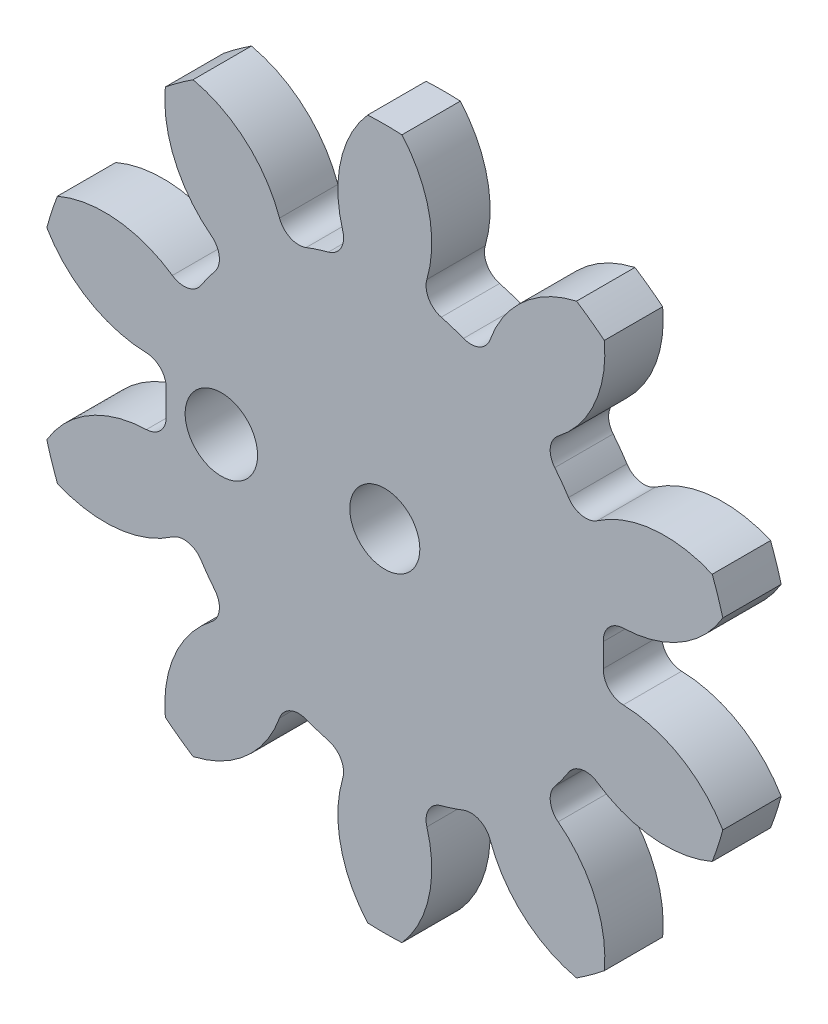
from build123d import *

# Parameters (mm, degrees)
BOSS_EXTRU_1_DEPTH                 = 5
CONG_1_R                           = 1.75
R_P_TITION_CIRCULAIRE4_COUNT       = 10
CONG_1_OF_R_P_TITION_CIRCULAIRE4_R = 1.75
ESQUISSE6_R                        = 3
ENL_V_MAT_EXTRU_1_DEPTH            = 10
ESQUISSE8_R                        = 3.1
ENL_V_MAT_EXTRU_3_DEPTH            = 42.990234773


with BuildPart() as part:
    # Esquisse3 → Boss.-Extru.1 (new body)
    with BuildSketch(Plane.XY):
        with BuildLine():
            Line((-5.794068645, 17.832309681), (0, 0))
            Line((0, 0), (5.794068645, 17.832309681))
            ThreePointArc((5.794068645, 17.832309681), (4.357814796, 18.236555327), (2.893965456, 18.525319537))
            ThreePointArc((2.893965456, 18.525319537), (3.941898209, 24.464041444), (1.468694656, 29.964027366))
            ThreePointArc((1.468694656, 29.964027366), (0, 30), (-1.468694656, 29.964027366))
            ThreePointArc((-1.468694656, 29.964027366), (-3.941898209, 24.464041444), (-2.893965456, 18.525319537))
            ThreePointArc((-2.893965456, 18.525319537), (-4.357814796, 18.236555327), (-5.794068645, 17.832309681))
        make_face()
    boss_extru_1 = extrude(amount=BOSS_EXTRU_1_DEPTH)

    # Cong_1
    cong_1_edges = [part.edges().sort_by_distance(p)[0] for p in [
        (-2.893965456, 18.525319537, 2.5),
        (2.893965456, 18.525319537, 2.5),
    ]]
    fillet(cong_1_edges, radius=CONG_1_R)

    # R_p_tition circulaire4: Boss.-Extru.1 ×10 about axis
    r_p_tition_circulaire4_axis = Axis((0, 0, 0), (0, 0, 1))
    for i in range(1, R_P_TITION_CIRCULAIRE4_COUNT):
        add(boss_extru_1.rotate(r_p_tition_circulaire4_axis, i * 360 / R_P_TITION_CIRCULAIRE4_COUNT))

    # Cong_1 of R_p_tition circulaire4
    cong_1_of_r_p_tition_circulaire4_edges = [part.edges().sort_by_distance(p)[0] for p in [
        (-13.230176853, 13.286268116, 2.5),
        (-8.547642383, 16.688328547, 2.5),
        (-18.512910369, 2.972313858, 2.5),
        (-16.724341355, 8.476963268, 2.5),
        (-16.724341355, -8.476963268, 2.5),
        (-18.512910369, -2.972313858, 2.5),
        (-8.547642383, -16.688328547, 2.5),
        (-13.230176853, -13.286268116, 2.5),
        (2.893965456, -18.525319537, 2.5),
        (-2.893965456, -18.525319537, 2.5),
        (13.230176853, -13.286268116, 2.5),
        (8.547642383, -16.688328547, 2.5),
        (18.512910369, -2.972313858, 2.5),
        (16.724341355, -8.476963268, 2.5),
        (16.724341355, 8.476963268, 2.5),
        (18.512910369, 2.972313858, 2.5),
        (8.547642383, 16.688328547, 2.5),
        (13.230176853, 13.286268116, 2.5),
    ]]
    fillet(cong_1_of_r_p_tition_circulaire4_edges, radius=CONG_1_OF_R_P_TITION_CIRCULAIRE4_R)

    # Esquisse6 → Enl_v. mat.-Extru.1 (cut)
    with BuildSketch(Plane.XY.offset(5)):
        Circle(ESQUISSE6_R)
    extrude(amount=-ENL_V_MAT_EXTRU_1_DEPTH, mode=Mode.SUBTRACT)

    # Esquisse8 → Enl_v. mat.-Extru.3 (cut, through all)
    with BuildSketch(Plane.XY.offset(5)):
        with Locations((-14, 0)):
            Circle(ESQUISSE8_R)
    extrude(amount=-ENL_V_MAT_EXTRU_3_DEPTH, mode=Mode.SUBTRACT)


solid = part.part
